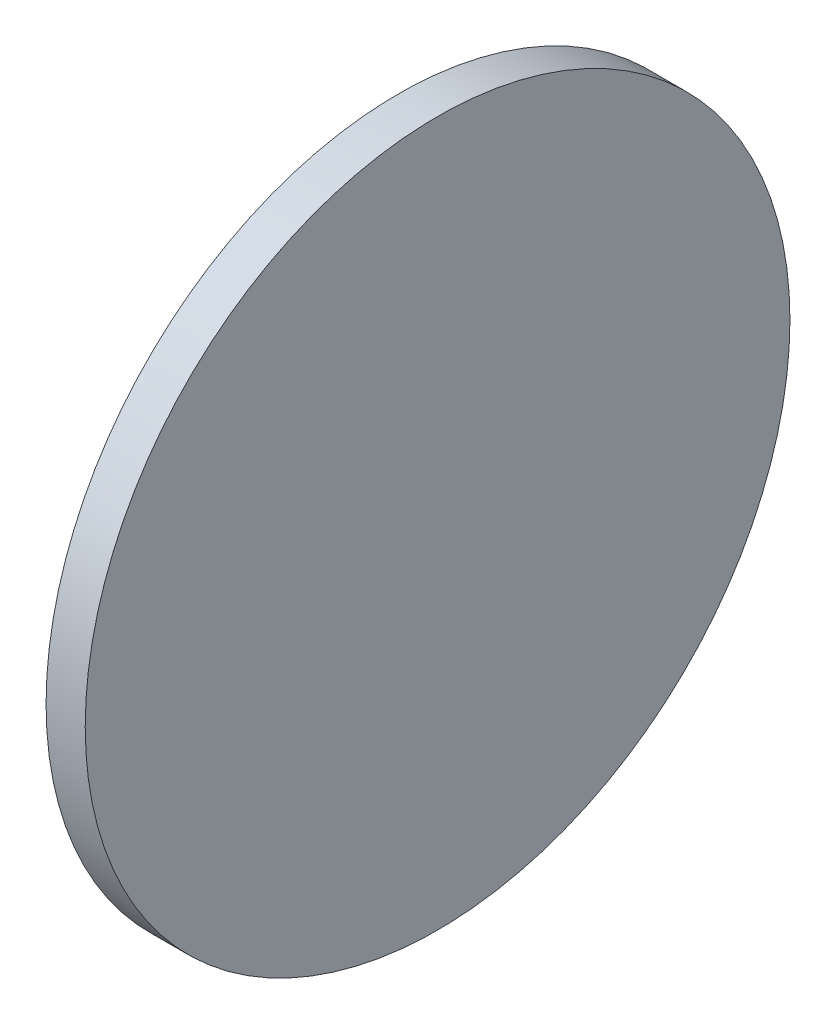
ISO-10303-21;
HEADER;
FILE_DESCRIPTION(('STEP AP214'),'2;1');
FILE_NAME('part.step','',(''),(''),'','','');
FILE_SCHEMA(('AUTOMOTIVE_DESIGN { 1 0 10303 214 1 1 1 1 }'));
ENDSEC;
DATA;
#1=APPLICATION_CONTEXT('core data for automotive mechanical design processes');
#2=APPLICATION_PROTOCOL_DEFINITION('international standard','automotive_design',2000,#1);
#3=PRODUCT_CONTEXT('',#1,'mechanical');
#4=PRODUCT('Part','Part','',(#3));
#5=PRODUCT_RELATED_PRODUCT_CATEGORY('part','',(#4));
#6=PRODUCT_DEFINITION_FORMATION('','',#4);
#7=PRODUCT_DEFINITION_CONTEXT('part definition',#1,'design');
#8=PRODUCT_DEFINITION('design','',#6,#7);
#9=PRODUCT_DEFINITION_SHAPE('','',#8);
#10=(LENGTH_UNIT() NAMED_UNIT(*) SI_UNIT(.MILLI.,.METRE.));
#11=(NAMED_UNIT(*) PLANE_ANGLE_UNIT() SI_UNIT($,.RADIAN.));
#12=(NAMED_UNIT(*) SI_UNIT($,.STERADIAN.) SOLID_ANGLE_UNIT());
#13=UNCERTAINTY_MEASURE_WITH_UNIT(LENGTH_MEASURE(1.E-05),#10,'distance_accuracy_value','');
#14=(GEOMETRIC_REPRESENTATION_CONTEXT(3) GLOBAL_UNCERTAINTY_ASSIGNED_CONTEXT((#13)) GLOBAL_UNIT_ASSIGNED_CONTEXT((#10,
#11,#12)) REPRESENTATION_CONTEXT('',''));
#15=CARTESIAN_POINT('',(0.,0.,0.));
#16=DIRECTION('',(0.,0.,1.));
#17=DIRECTION('',(1.,0.,0.));
#18=AXIS2_PLACEMENT_3D('',#15,#16,#17);
#19=CARTESIAN_POINT('',(5.,0.,0.));
#20=DIRECTION('',(1.,0.,0.));
#21=DIRECTION('',(0.,0.,-1.));
#22=AXIS2_PLACEMENT_3D('',#19,#20,#21);
#23=PLANE('',#22);
#24=CARTESIAN_POINT('',(5.,0.,0.));
#25=DIRECTION('',(1.,0.,0.));
#26=DIRECTION('',(0.,0.,-1.));
#27=AXIS2_PLACEMENT_3D('',#24,#25,#26);
#28=CIRCLE('',#27,45.);
#29=CARTESIAN_POINT('',(5.,0.,-45.));
#30=VERTEX_POINT('',#29);
#31=EDGE_CURVE('E17',#30,#30,#28,.F.);
#32=ORIENTED_EDGE('',*,*,#31,.F.);
#33=EDGE_LOOP('',(#32));
#34=FACE_BOUND('',#33,.T.);
#35=ADVANCED_FACE('F14',(#34),#23,.T.);
#36=CARTESIAN_POINT('',(0.,0.,0.));
#37=DIRECTION('',(1.,0.,0.));
#38=DIRECTION('',(0.,0.,-1.));
#39=AXIS2_PLACEMENT_3D('',#36,#37,#38);
#40=CYLINDRICAL_SURFACE('',#39,45.);
#41=ORIENTED_EDGE('',*,*,#31,.T.);
#42=EDGE_LOOP('',(#41));
#43=FACE_BOUND('',#42,.T.);
#44=CARTESIAN_POINT('',(0.,0.,0.));
#45=DIRECTION('',(1.,0.,0.));
#46=DIRECTION('',(0.,0.,-1.));
#47=AXIS2_PLACEMENT_3D('',#44,#45,#46);
#48=CIRCLE('',#47,45.);
#49=CARTESIAN_POINT('',(0.,0.,-45.));
#50=VERTEX_POINT('',#49);
#51=EDGE_CURVE('E10',#50,#50,#48,.T.);
#52=ORIENTED_EDGE('',*,*,#51,.T.);
#53=EDGE_LOOP('',(#52));
#54=FACE_BOUND('',#53,.T.);
#55=ADVANCED_FACE('F26',(#43,#54),#40,.T.);
#56=CARTESIAN_POINT('',(0.,0.,0.));
#57=DIRECTION('',(1.,0.,0.));
#58=DIRECTION('',(0.,0.,-1.));
#59=AXIS2_PLACEMENT_3D('',#56,#57,#58);
#60=PLANE('',#59);
#61=ORIENTED_EDGE('',*,*,#51,.F.);
#62=EDGE_LOOP('',(#61));
#63=FACE_BOUND('',#62,.T.);
#64=ADVANCED_FACE('F34',(#63),#60,.F.);
#65=CLOSED_SHELL('',(#35,#55,#64));
#66=MANIFOLD_SOLID_BREP('B1',#65);
#67=ADVANCED_BREP_SHAPE_REPRESENTATION('',(#18,#66),#14);
#68=SHAPE_DEFINITION_REPRESENTATION(#9,#67);
ENDSEC;
END-ISO-10303-21;
